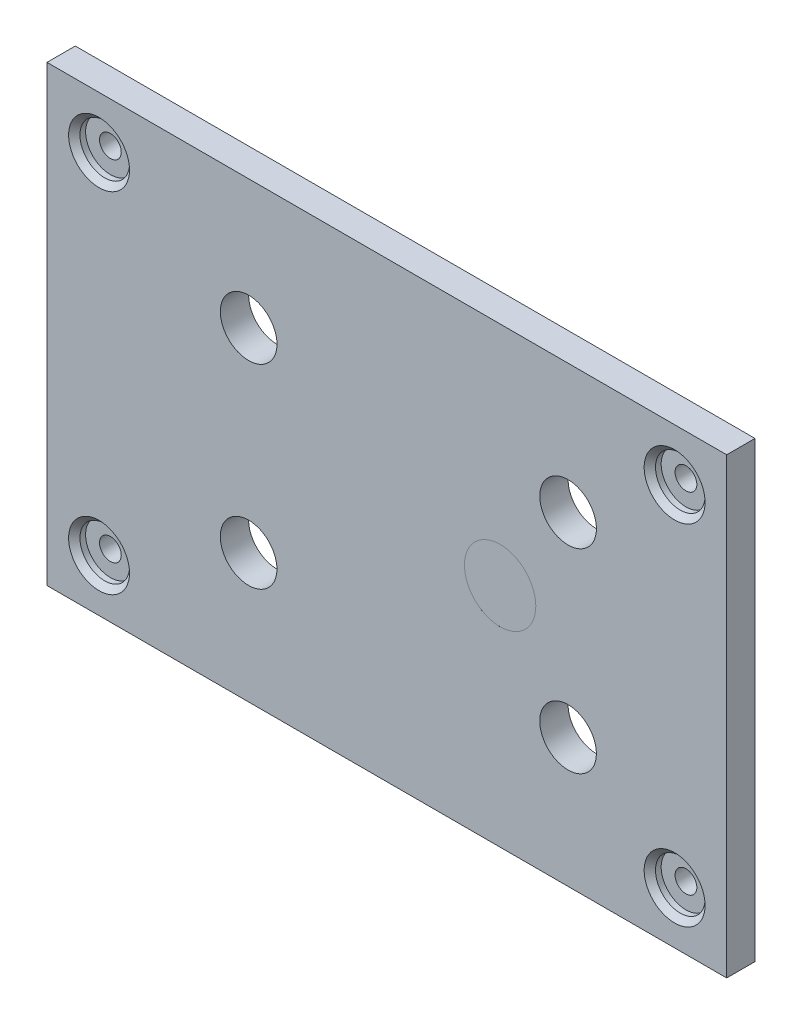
ISO-10303-21;
HEADER;
FILE_DESCRIPTION(('STEP AP214'),'2;1');
FILE_NAME('part.step','',(''),(''),'','','');
FILE_SCHEMA(('AUTOMOTIVE_DESIGN { 1 0 10303 214 1 1 1 1 }'));
ENDSEC;
DATA;
#1=APPLICATION_CONTEXT('core data for automotive mechanical design processes');
#2=APPLICATION_PROTOCOL_DEFINITION('international standard','automotive_design',2000,#1);
#3=PRODUCT_CONTEXT('',#1,'mechanical');
#4=PRODUCT('Part','Part','',(#3));
#5=PRODUCT_RELATED_PRODUCT_CATEGORY('part','',(#4));
#6=PRODUCT_DEFINITION_FORMATION('','',#4);
#7=PRODUCT_DEFINITION_CONTEXT('part definition',#1,'design');
#8=PRODUCT_DEFINITION('design','',#6,#7);
#9=PRODUCT_DEFINITION_SHAPE('','',#8);
#10=(LENGTH_UNIT() NAMED_UNIT(*) SI_UNIT(.MILLI.,.METRE.));
#11=(NAMED_UNIT(*) PLANE_ANGLE_UNIT() SI_UNIT($,.RADIAN.));
#12=(NAMED_UNIT(*) SI_UNIT($,.STERADIAN.) SOLID_ANGLE_UNIT());
#13=UNCERTAINTY_MEASURE_WITH_UNIT(LENGTH_MEASURE(1.E-05),#10,'distance_accuracy_value','');
#14=(GEOMETRIC_REPRESENTATION_CONTEXT(3) GLOBAL_UNCERTAINTY_ASSIGNED_CONTEXT((#13)) GLOBAL_UNIT_ASSIGNED_CONTEXT((#10,
#11,#12)) REPRESENTATION_CONTEXT('',''));
#15=CARTESIAN_POINT('',(0.,0.,0.));
#16=DIRECTION('',(0.,0.,1.));
#17=DIRECTION('',(1.,0.,0.));
#18=AXIS2_PLACEMENT_3D('',#15,#16,#17);
#19=CARTESIAN_POINT('',(0.,0.,3.175));
#20=DIRECTION('',(1.,0.,0.));
#21=DIRECTION('',(0.,0.,-1.));
#22=AXIS2_PLACEMENT_3D('',#19,#20,#21);
#23=PLANE('',#22);
#24=DIRECTION('',(0.,-1.,0.));
#25=VECTOR('',#24,1.);
#26=CARTESIAN_POINT('',(0.,0.,0.));
#27=LINE('',#26,#25);
#28=CARTESIAN_POINT('',(0.,50.8,0.));
#29=VERTEX_POINT('',#28);
#30=CARTESIAN_POINT('',(0.,0.,0.));
#31=VERTEX_POINT('',#30);
#32=EDGE_CURVE('E116',#29,#31,#27,.T.);
#33=ORIENTED_EDGE('',*,*,#32,.T.);
#34=DIRECTION('',(0.,0.,-1.));
#35=VECTOR('',#34,1.);
#36=CARTESIAN_POINT('',(0.,0.,3.175));
#37=LINE('',#36,#35);
#38=CARTESIAN_POINT('',(0.,0.,3.175));
#39=VERTEX_POINT('',#38);
#40=EDGE_CURVE('E11',#39,#31,#37,.T.);
#41=ORIENTED_EDGE('',*,*,#40,.F.);
#42=DIRECTION('',(0.,-1.,0.));
#43=VECTOR('',#42,1.);
#44=CARTESIAN_POINT('',(0.,0.,3.175));
#45=LINE('',#44,#43);
#46=CARTESIAN_POINT('',(0.,50.8,3.175));
#47=VERTEX_POINT('',#46);
#48=EDGE_CURVE('E99',#47,#39,#45,.T.);
#49=ORIENTED_EDGE('',*,*,#48,.F.);
#50=DIRECTION('',(0.,0.,-1.));
#51=VECTOR('',#50,1.);
#52=CARTESIAN_POINT('',(0.,50.8,3.175));
#53=LINE('',#52,#51);
#54=EDGE_CURVE('E112',#47,#29,#53,.T.);
#55=ORIENTED_EDGE('',*,*,#54,.T.);
#56=EDGE_LOOP('',(#33,#41,#49,#55));
#57=FACE_BOUND('',#56,.T.);
#58=ADVANCED_FACE('F45',(#57),#23,.F.);
#59=CARTESIAN_POINT('',(0.,0.,3.175));
#60=DIRECTION('',(0.,1.,0.));
#61=DIRECTION('',(0.,0.,1.));
#62=AXIS2_PLACEMENT_3D('',#59,#60,#61);
#63=PLANE('',#62);
#64=DIRECTION('',(1.,0.,0.));
#65=VECTOR('',#64,1.);
#66=CARTESIAN_POINT('',(0.,0.,0.));
#67=LINE('',#66,#65);
#68=CARTESIAN_POINT('',(76.2,0.,0.));
#69=VERTEX_POINT('',#68);
#70=EDGE_CURVE('E104',#31,#69,#67,.T.);
#71=ORIENTED_EDGE('',*,*,#70,.T.);
#72=DIRECTION('',(0.,0.,-1.));
#73=VECTOR('',#72,1.);
#74=CARTESIAN_POINT('',(76.2,0.,3.175));
#75=LINE('',#74,#73);
#76=CARTESIAN_POINT('',(76.2,0.,3.175));
#77=VERTEX_POINT('',#76);
#78=EDGE_CURVE('E55',#77,#69,#75,.T.);
#79=ORIENTED_EDGE('',*,*,#78,.F.);
#80=DIRECTION('',(1.,0.,0.));
#81=VECTOR('',#80,1.);
#82=CARTESIAN_POINT('',(0.,0.,3.175));
#83=LINE('',#82,#81);
#84=EDGE_CURVE('E94',#39,#77,#83,.T.);
#85=ORIENTED_EDGE('',*,*,#84,.F.);
#86=ORIENTED_EDGE('',*,*,#40,.T.);
#87=EDGE_LOOP('',(#71,#79,#85,#86));
#88=FACE_BOUND('',#87,.T.);
#89=ADVANCED_FACE('F103',(#88),#63,.F.);
#90=CARTESIAN_POINT('',(76.2,0.,3.175));
#91=DIRECTION('',(-1.,0.,0.));
#92=DIRECTION('',(0.,0.,1.));
#93=AXIS2_PLACEMENT_3D('',#90,#91,#92);
#94=PLANE('',#93);
#95=DIRECTION('',(0.,1.,0.));
#96=VECTOR('',#95,1.);
#97=CARTESIAN_POINT('',(76.2,0.,0.));
#98=LINE('',#97,#96);
#99=CARTESIAN_POINT('',(76.2,50.8,0.));
#100=VERTEX_POINT('',#99);
#101=EDGE_CURVE('E81',#69,#100,#98,.T.);
#102=ORIENTED_EDGE('',*,*,#101,.T.);
#103=DIRECTION('',(0.,0.,-1.));
#104=VECTOR('',#103,1.);
#105=CARTESIAN_POINT('',(76.2,50.8,3.175));
#106=LINE('',#105,#104);
#107=CARTESIAN_POINT('',(76.2,50.8,3.175));
#108=VERTEX_POINT('',#107);
#109=EDGE_CURVE('E106',#108,#100,#106,.T.);
#110=ORIENTED_EDGE('',*,*,#109,.F.);
#111=DIRECTION('',(0.,1.,0.));
#112=VECTOR('',#111,1.);
#113=CARTESIAN_POINT('',(76.2,0.,3.175));
#114=LINE('',#113,#112);
#115=EDGE_CURVE('E97',#77,#108,#114,.T.);
#116=ORIENTED_EDGE('',*,*,#115,.F.);
#117=ORIENTED_EDGE('',*,*,#78,.T.);
#118=EDGE_LOOP('',(#102,#110,#116,#117));
#119=FACE_BOUND('',#118,.T.);
#120=ADVANCED_FACE('F108',(#119),#94,.F.);
#121=CARTESIAN_POINT('',(0.,50.8,3.175));
#122=DIRECTION('',(0.,-1.,0.));
#123=DIRECTION('',(0.,0.,-1.));
#124=AXIS2_PLACEMENT_3D('',#121,#122,#123);
#125=PLANE('',#124);
#126=DIRECTION('',(-1.,0.,0.));
#127=VECTOR('',#126,1.);
#128=CARTESIAN_POINT('',(0.,50.8,0.));
#129=LINE('',#128,#127);
#130=EDGE_CURVE('E87',#100,#29,#129,.T.);
#131=ORIENTED_EDGE('',*,*,#130,.T.);
#132=ORIENTED_EDGE('',*,*,#54,.F.);
#133=DIRECTION('',(-1.,0.,0.));
#134=VECTOR('',#133,1.);
#135=CARTESIAN_POINT('',(0.,50.8,3.175));
#136=LINE('',#135,#134);
#137=EDGE_CURVE('E64',#108,#47,#136,.T.);
#138=ORIENTED_EDGE('',*,*,#137,.F.);
#139=ORIENTED_EDGE('',*,*,#109,.T.);
#140=EDGE_LOOP('',(#131,#132,#138,#139));
#141=FACE_BOUND('',#140,.T.);
#142=ADVANCED_FACE('F212',(#141),#125,.F.);
#143=CARTESIAN_POINT('',(0.,0.,3.175));
#144=DIRECTION('',(0.,0.,-1.));
#145=DIRECTION('',(-1.,0.,0.));
#146=AXIS2_PLACEMENT_3D('',#143,#144,#145);
#147=PLANE('',#146);
#148=CARTESIAN_POINT('',(58.4214304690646,36.3210018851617,3.175));
#149=DIRECTION('',(0.,0.,1.));
#150=DIRECTION('',(1.,0.,0.));
#151=AXIS2_PLACEMENT_3D('',#148,#149,#150);
#152=CIRCLE('',#151,3.175);
#153=CARTESIAN_POINT('',(61.5964304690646,36.3210018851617,3.175));
#154=VERTEX_POINT('',#153);
#155=EDGE_CURVE('E439',#154,#154,#152,.T.);
#156=ORIENTED_EDGE('',*,*,#155,.F.);
#157=EDGE_LOOP('',(#156));
#158=FACE_BOUND('',#157,.T.);
#159=CARTESIAN_POINT('',(22.6030007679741,14.4857454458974,3.175));
#160=DIRECTION('',(0.,0.,1.));
#161=DIRECTION('',(1.,0.,0.));
#162=AXIS2_PLACEMENT_3D('',#159,#160,#161);
#163=CIRCLE('',#162,3.175);
#164=CARTESIAN_POINT('',(25.7780007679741,14.4857454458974,3.175));
#165=VERTEX_POINT('',#164);
#166=EDGE_CURVE('E448',#165,#165,#163,.T.);
#167=ORIENTED_EDGE('',*,*,#166,.F.);
#168=EDGE_LOOP('',(#167));
#169=FACE_BOUND('',#168,.T.);
#170=CARTESIAN_POINT('',(58.4176178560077,14.4763383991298,3.175));
#171=DIRECTION('',(0.,0.,1.));
#172=DIRECTION('',(1.,0.,0.));
#173=AXIS2_PLACEMENT_3D('',#170,#171,#172);
#174=CIRCLE('',#173,3.175);
#175=CARTESIAN_POINT('',(61.5926178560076,14.4763383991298,3.175));
#176=VERTEX_POINT('',#175);
#177=EDGE_CURVE('E461',#176,#176,#174,.T.);
#178=ORIENTED_EDGE('',*,*,#177,.F.);
#179=EDGE_LOOP('',(#178));
#180=FACE_BOUND('',#179,.T.);
#181=CARTESIAN_POINT('',(22.6068122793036,36.3240964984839,3.175));
#182=DIRECTION('',(0.,0.,1.));
#183=DIRECTION('',(1.,0.,0.));
#184=AXIS2_PLACEMENT_3D('',#181,#182,#183);
#185=CIRCLE('',#184,3.175);
#186=CARTESIAN_POINT('',(25.7818122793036,36.3240964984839,3.175));
#187=VERTEX_POINT('',#186);
#188=EDGE_CURVE('E441',#187,#187,#185,.T.);
#189=ORIENTED_EDGE('',*,*,#188,.F.);
#190=EDGE_LOOP('',(#189));
#191=FACE_BOUND('',#190,.T.);
#192=CARTESIAN_POINT('',(50.8,25.4,3.175));
#193=DIRECTION('',(0.,0.,1.));
#194=DIRECTION('',(1.,0.,0.));
#195=AXIS2_PLACEMENT_3D('',#192,#193,#194);
#196=CIRCLE('',#195,4.0005);
#197=CARTESIAN_POINT('',(54.8005,25.4,3.175));
#198=VERTEX_POINT('',#197);
#199=EDGE_CURVE('E464',#198,#198,#196,.T.);
#200=ORIENTED_EDGE('',*,*,#199,.F.);
#201=EDGE_LOOP('',(#200));
#202=FACE_BOUND('',#201,.T.);
#203=CARTESIAN_POINT('',(5.83716647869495,44.9628335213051,3.175));
#204=DIRECTION('',(0.,0.,1.));
#205=DIRECTION('',(1.,0.,0.));
#206=AXIS2_PLACEMENT_3D('',#203,#204,#205);
#207=CIRCLE('',#206,3.41376);
#208=CARTESIAN_POINT('',(9.25092647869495,44.9628335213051,3.175));
#209=VERTEX_POINT('',#208);
#210=EDGE_CURVE('E470',#209,#209,#207,.T.);
#211=ORIENTED_EDGE('',*,*,#210,.F.);
#212=EDGE_LOOP('',(#211));
#213=FACE_BOUND('',#212,.T.);
#214=CARTESIAN_POINT('',(70.362833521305,44.9628335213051,3.175));
#215=DIRECTION('',(0.,0.,1.));
#216=DIRECTION('',(1.,0.,0.));
#217=AXIS2_PLACEMENT_3D('',#214,#215,#216);
#218=CIRCLE('',#217,3.41376);
#219=CARTESIAN_POINT('',(73.776593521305,44.9628335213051,3.175));
#220=VERTEX_POINT('',#219);
#221=EDGE_CURVE('E489',#220,#220,#218,.T.);
#222=ORIENTED_EDGE('',*,*,#221,.F.);
#223=EDGE_LOOP('',(#222));
#224=FACE_BOUND('',#223,.T.);
#225=CARTESIAN_POINT('',(5.83716647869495,5.83716647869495,3.175));
#226=DIRECTION('',(0.,0.,1.));
#227=DIRECTION('',(1.,0.,0.));
#228=AXIS2_PLACEMENT_3D('',#225,#226,#227);
#229=CIRCLE('',#228,3.41376);
#230=CARTESIAN_POINT('',(9.25092647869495,5.83716647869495,3.175));
#231=VERTEX_POINT('',#230);
#232=EDGE_CURVE('E143',#231,#231,#229,.T.);
#233=ORIENTED_EDGE('',*,*,#232,.F.);
#234=EDGE_LOOP('',(#233));
#235=FACE_BOUND('',#234,.T.);
#236=CARTESIAN_POINT('',(70.362833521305,5.83716647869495,3.175));
#237=DIRECTION('',(0.,0.,1.));
#238=DIRECTION('',(1.,0.,0.));
#239=AXIS2_PLACEMENT_3D('',#236,#237,#238);
#240=CIRCLE('',#239,3.41376);
#241=CARTESIAN_POINT('',(73.776593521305,5.83716647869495,3.175));
#242=VERTEX_POINT('',#241);
#243=EDGE_CURVE('E138',#242,#242,#240,.T.);
#244=ORIENTED_EDGE('',*,*,#243,.F.);
#245=EDGE_LOOP('',(#244));
#246=FACE_BOUND('',#245,.T.);
#247=ORIENTED_EDGE('',*,*,#48,.T.);
#248=ORIENTED_EDGE('',*,*,#84,.T.);
#249=ORIENTED_EDGE('',*,*,#115,.T.);
#250=ORIENTED_EDGE('',*,*,#137,.T.);
#251=EDGE_LOOP('',(#247,#248,#249,#250));
#252=FACE_BOUND('',#251,.T.);
#253=ADVANCED_FACE('F95',(#158,#169,#180,#191,#202,#213,#224,#235,#246,#252),#147,.F.);
#254=CARTESIAN_POINT('',(0.,0.,0.));
#255=DIRECTION('',(0.,0.,-1.));
#256=DIRECTION('',(-1.,0.,0.));
#257=AXIS2_PLACEMENT_3D('',#254,#255,#256);
#258=PLANE('',#257);
#259=CARTESIAN_POINT('',(58.4214304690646,36.3210018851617,0.));
#260=DIRECTION('',(0.,0.,1.));
#261=DIRECTION('',(1.,0.,0.));
#262=AXIS2_PLACEMENT_3D('',#259,#260,#261);
#263=CIRCLE('',#262,3.175);
#264=CARTESIAN_POINT('',(61.5964304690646,36.3210018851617,0.));
#265=VERTEX_POINT('',#264);
#266=EDGE_CURVE('E437',#265,#265,#263,.T.);
#267=ORIENTED_EDGE('',*,*,#266,.T.);
#268=EDGE_LOOP('',(#267));
#269=FACE_BOUND('',#268,.T.);
#270=CARTESIAN_POINT('',(22.6030007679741,14.4857454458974,0.));
#271=DIRECTION('',(0.,0.,1.));
#272=DIRECTION('',(1.,0.,0.));
#273=AXIS2_PLACEMENT_3D('',#270,#271,#272);
#274=CIRCLE('',#273,3.175);
#275=CARTESIAN_POINT('',(25.7780007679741,14.4857454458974,0.));
#276=VERTEX_POINT('',#275);
#277=EDGE_CURVE('E457',#276,#276,#274,.T.);
#278=ORIENTED_EDGE('',*,*,#277,.T.);
#279=EDGE_LOOP('',(#278));
#280=FACE_BOUND('',#279,.T.);
#281=CARTESIAN_POINT('',(58.4176178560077,14.4763383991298,0.));
#282=DIRECTION('',(0.,0.,1.));
#283=DIRECTION('',(1.,0.,0.));
#284=AXIS2_PLACEMENT_3D('',#281,#282,#283);
#285=CIRCLE('',#284,3.175);
#286=CARTESIAN_POINT('',(61.5926178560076,14.4763383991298,0.));
#287=VERTEX_POINT('',#286);
#288=EDGE_CURVE('E451',#287,#287,#285,.T.);
#289=ORIENTED_EDGE('',*,*,#288,.T.);
#290=EDGE_LOOP('',(#289));
#291=FACE_BOUND('',#290,.T.);
#292=CARTESIAN_POINT('',(22.6068122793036,36.3240964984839,0.));
#293=DIRECTION('',(0.,0.,1.));
#294=DIRECTION('',(1.,0.,0.));
#295=AXIS2_PLACEMENT_3D('',#292,#293,#294);
#296=CIRCLE('',#295,3.175);
#297=CARTESIAN_POINT('',(25.7818122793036,36.3240964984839,0.));
#298=VERTEX_POINT('',#297);
#299=EDGE_CURVE('E446',#298,#298,#296,.T.);
#300=ORIENTED_EDGE('',*,*,#299,.T.);
#301=EDGE_LOOP('',(#300));
#302=FACE_BOUND('',#301,.T.);
#303=CARTESIAN_POINT('',(5.83716647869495,44.9628335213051,0.));
#304=DIRECTION('',(0.,0.,-1.));
#305=DIRECTION('',(-1.,0.,0.));
#306=AXIS2_PLACEMENT_3D('',#303,#304,#305);
#307=CIRCLE('',#306,1.2192);
#308=CARTESIAN_POINT('',(4.61796647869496,44.9628335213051,0.));
#309=VERTEX_POINT('',#308);
#310=EDGE_CURVE('E48',#309,#309,#307,.T.);
#311=ORIENTED_EDGE('',*,*,#310,.F.);
#312=EDGE_LOOP('',(#311));
#313=FACE_BOUND('',#312,.T.);
#314=CARTESIAN_POINT('',(70.362833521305,44.9628335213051,0.));
#315=DIRECTION('',(0.,0.,-1.));
#316=DIRECTION('',(-1.,0.,0.));
#317=AXIS2_PLACEMENT_3D('',#314,#315,#316);
#318=CIRCLE('',#317,1.2192);
#319=CARTESIAN_POINT('',(69.143633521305,44.9628335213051,0.));
#320=VERTEX_POINT('',#319);
#321=EDGE_CURVE('E140',#320,#320,#318,.T.);
#322=ORIENTED_EDGE('',*,*,#321,.F.);
#323=EDGE_LOOP('',(#322));
#324=FACE_BOUND('',#323,.T.);
#325=CARTESIAN_POINT('',(5.83716647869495,5.83716647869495,0.));
#326=DIRECTION('',(0.,0.,-1.));
#327=DIRECTION('',(-1.,0.,0.));
#328=AXIS2_PLACEMENT_3D('',#325,#326,#327);
#329=CIRCLE('',#328,1.2192);
#330=CARTESIAN_POINT('',(4.61796647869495,5.83716647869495,0.));
#331=VERTEX_POINT('',#330);
#332=EDGE_CURVE('E135',#331,#331,#329,.T.);
#333=ORIENTED_EDGE('',*,*,#332,.F.);
#334=EDGE_LOOP('',(#333));
#335=FACE_BOUND('',#334,.T.);
#336=CARTESIAN_POINT('',(70.362833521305,5.83716647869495,0.));
#337=DIRECTION('',(0.,0.,-1.));
#338=DIRECTION('',(-1.,0.,0.));
#339=AXIS2_PLACEMENT_3D('',#336,#337,#338);
#340=CIRCLE('',#339,1.2192);
#341=CARTESIAN_POINT('',(69.143633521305,5.83716647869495,0.));
#342=VERTEX_POINT('',#341);
#343=EDGE_CURVE('E120',#342,#342,#340,.T.);
#344=ORIENTED_EDGE('',*,*,#343,.F.);
#345=EDGE_LOOP('',(#344));
#346=FACE_BOUND('',#345,.T.);
#347=ORIENTED_EDGE('',*,*,#32,.F.);
#348=ORIENTED_EDGE('',*,*,#130,.F.);
#349=ORIENTED_EDGE('',*,*,#101,.F.);
#350=ORIENTED_EDGE('',*,*,#70,.F.);
#351=EDGE_LOOP('',(#347,#348,#349,#350));
#352=FACE_BOUND('',#351,.T.);
#353=ADVANCED_FACE('F211',(#269,#280,#291,#302,#313,#324,#335,#346,#352),#258,.T.);
#354=CARTESIAN_POINT('',(70.362833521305,5.83716647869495,3.175));
#355=DIRECTION('',(0.,0.,1.));
#356=DIRECTION('',(1.,0.,0.));
#357=AXIS2_PLACEMENT_3D('',#354,#355,#356);
#358=CYLINDRICAL_SURFACE('',#357,1.2192);
#359=ORIENTED_EDGE('',*,*,#343,.T.);
#360=EDGE_LOOP('',(#359));
#361=FACE_BOUND('',#360,.T.);
#362=CARTESIAN_POINT('',(70.362833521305,5.83716647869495,1.905));
#363=DIRECTION('',(0.,0.,1.));
#364=DIRECTION('',(1.,0.,0.));
#365=AXIS2_PLACEMENT_3D('',#362,#363,#364);
#366=CIRCLE('',#365,1.2192);
#367=CARTESIAN_POINT('',(71.582033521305,5.83716647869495,1.905));
#368=VERTEX_POINT('',#367);
#369=EDGE_CURVE('E134',#368,#368,#366,.T.);
#370=ORIENTED_EDGE('',*,*,#369,.T.);
#371=EDGE_LOOP('',(#370));
#372=FACE_BOUND('',#371,.T.);
#373=ADVANCED_FACE('F189',(#361,#372),#358,.F.);
#374=CARTESIAN_POINT('',(71.582033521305,5.83716647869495,1.905));
#375=DIRECTION('',(0.,0.,-1.));
#376=DIRECTION('',(-1.,0.,0.));
#377=AXIS2_PLACEMENT_3D('',#374,#375,#376);
#378=PLANE('',#377);
#379=ORIENTED_EDGE('',*,*,#369,.F.);
#380=EDGE_LOOP('',(#379));
#381=FACE_BOUND('',#380,.T.);
#382=CARTESIAN_POINT('',(70.362833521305,5.83716647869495,1.905));
#383=DIRECTION('',(0.,0.,1.));
#384=DIRECTION('',(1.,0.,0.));
#385=AXIS2_PLACEMENT_3D('',#382,#383,#384);
#386=CIRCLE('',#385,2.77876000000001);
#387=CARTESIAN_POINT('',(73.141593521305,5.83716647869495,1.905));
#388=VERTEX_POINT('',#387);
#389=EDGE_CURVE('E180',#388,#388,#386,.T.);
#390=ORIENTED_EDGE('',*,*,#389,.T.);
#391=EDGE_LOOP('',(#390));
#392=FACE_BOUND('',#391,.T.);
#393=ADVANCED_FACE('F191',(#381,#392),#378,.F.);
#394=CARTESIAN_POINT('',(70.362833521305,5.83716647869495,3.175));
#395=DIRECTION('',(0.,0.,1.));
#396=DIRECTION('',(1.,0.,0.));
#397=AXIS2_PLACEMENT_3D('',#394,#395,#396);
#398=CYLINDRICAL_SURFACE('',#397,2.77876000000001);
#399=ORIENTED_EDGE('',*,*,#389,.F.);
#400=EDGE_LOOP('',(#399));
#401=FACE_BOUND('',#400,.T.);
#402=CARTESIAN_POINT('',(70.362833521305,5.83716647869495,2.54));
#403=DIRECTION('',(0.,0.,1.));
#404=DIRECTION('',(1.,0.,0.));
#405=AXIS2_PLACEMENT_3D('',#402,#403,#404);
#406=CIRCLE('',#405,2.77876000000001);
#407=CARTESIAN_POINT('',(73.141593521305,5.83716647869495,2.54));
#408=VERTEX_POINT('',#407);
#409=EDGE_CURVE('E176',#408,#408,#406,.T.);
#410=ORIENTED_EDGE('',*,*,#409,.T.);
#411=EDGE_LOOP('',(#410));
#412=FACE_BOUND('',#411,.T.);
#413=ADVANCED_FACE('F194',(#401,#412),#398,.F.);
#414=CARTESIAN_POINT('',(70.362833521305,5.83716647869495,3.175));
#415=DIRECTION('',(0.,0.,1.));
#416=DIRECTION('',(1.,0.,0.));
#417=AXIS2_PLACEMENT_3D('',#414,#415,#416);
#418=CONICAL_SURFACE('',#417,3.41376,0.785398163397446);
#419=ORIENTED_EDGE('',*,*,#409,.F.);
#420=EDGE_LOOP('',(#419));
#421=FACE_BOUND('',#420,.T.);
#422=ORIENTED_EDGE('',*,*,#243,.T.);
#423=EDGE_LOOP('',(#422));
#424=FACE_BOUND('',#423,.T.);
#425=ADVANCED_FACE('F200',(#421,#424),#418,.F.);
#426=CARTESIAN_POINT('',(5.83716647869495,5.83716647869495,3.175));
#427=DIRECTION('',(0.,0.,1.));
#428=DIRECTION('',(1.,0.,0.));
#429=AXIS2_PLACEMENT_3D('',#426,#427,#428);
#430=CYLINDRICAL_SURFACE('',#429,1.2192);
#431=ORIENTED_EDGE('',*,*,#332,.T.);
#432=EDGE_LOOP('',(#431));
#433=FACE_BOUND('',#432,.T.);
#434=CARTESIAN_POINT('',(5.83716647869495,5.83716647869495,1.905));
#435=DIRECTION('',(0.,0.,1.));
#436=DIRECTION('',(1.,0.,0.));
#437=AXIS2_PLACEMENT_3D('',#434,#435,#436);
#438=CIRCLE('',#437,1.2192);
#439=CARTESIAN_POINT('',(7.05636647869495,5.83716647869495,1.905));
#440=VERTEX_POINT('',#439);
#441=EDGE_CURVE('E139',#440,#440,#438,.T.);
#442=ORIENTED_EDGE('',*,*,#441,.T.);
#443=EDGE_LOOP('',(#442));
#444=FACE_BOUND('',#443,.T.);
#445=ADVANCED_FACE('F206',(#433,#444),#430,.F.);
#446=CARTESIAN_POINT('',(7.05636647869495,5.83716647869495,1.905));
#447=DIRECTION('',(0.,0.,-1.));
#448=DIRECTION('',(-1.,0.,0.));
#449=AXIS2_PLACEMENT_3D('',#446,#447,#448);
#450=PLANE('',#449);
#451=ORIENTED_EDGE('',*,*,#441,.F.);
#452=EDGE_LOOP('',(#451));
#453=FACE_BOUND('',#452,.T.);
#454=CARTESIAN_POINT('',(5.83716647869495,5.83716647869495,1.905));
#455=DIRECTION('',(0.,0.,1.));
#456=DIRECTION('',(1.,0.,0.));
#457=AXIS2_PLACEMENT_3D('',#454,#455,#456);
#458=CIRCLE('',#457,2.77876);
#459=CARTESIAN_POINT('',(8.61592647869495,5.83716647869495,1.905));
#460=VERTEX_POINT('',#459);
#461=EDGE_CURVE('E166',#460,#460,#458,.T.);
#462=ORIENTED_EDGE('',*,*,#461,.T.);
#463=EDGE_LOOP('',(#462));
#464=FACE_BOUND('',#463,.T.);
#465=ADVANCED_FACE('F274',(#453,#464),#450,.F.);
#466=CARTESIAN_POINT('',(5.83716647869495,5.83716647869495,3.175));
#467=DIRECTION('',(0.,0.,1.));
#468=DIRECTION('',(1.,0.,0.));
#469=AXIS2_PLACEMENT_3D('',#466,#467,#468);
#470=CYLINDRICAL_SURFACE('',#469,2.77876);
#471=ORIENTED_EDGE('',*,*,#461,.F.);
#472=EDGE_LOOP('',(#471));
#473=FACE_BOUND('',#472,.T.);
#474=CARTESIAN_POINT('',(5.83716647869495,5.83716647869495,2.54));
#475=DIRECTION('',(0.,0.,1.));
#476=DIRECTION('',(1.,0.,0.));
#477=AXIS2_PLACEMENT_3D('',#474,#475,#476);
#478=CIRCLE('',#477,2.77876);
#479=CARTESIAN_POINT('',(8.61592647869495,5.83716647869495,2.54));
#480=VERTEX_POINT('',#479);
#481=EDGE_CURVE('E150',#480,#480,#478,.T.);
#482=ORIENTED_EDGE('',*,*,#481,.T.);
#483=EDGE_LOOP('',(#482));
#484=FACE_BOUND('',#483,.T.);
#485=ADVANCED_FACE('F283',(#473,#484),#470,.F.);
#486=CARTESIAN_POINT('',(5.83716647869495,5.83716647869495,3.175));
#487=DIRECTION('',(0.,0.,1.));
#488=DIRECTION('',(1.,0.,0.));
#489=AXIS2_PLACEMENT_3D('',#486,#487,#488);
#490=CONICAL_SURFACE('',#489,3.41376,0.785398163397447);
#491=ORIENTED_EDGE('',*,*,#481,.F.);
#492=EDGE_LOOP('',(#491));
#493=FACE_BOUND('',#492,.T.);
#494=ORIENTED_EDGE('',*,*,#232,.T.);
#495=EDGE_LOOP('',(#494));
#496=FACE_BOUND('',#495,.T.);
#497=ADVANCED_FACE('F292',(#493,#496),#490,.F.);
#498=CARTESIAN_POINT('',(70.362833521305,44.9628335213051,3.175));
#499=DIRECTION('',(0.,0.,1.));
#500=DIRECTION('',(1.,0.,0.));
#501=AXIS2_PLACEMENT_3D('',#498,#499,#500);
#502=CYLINDRICAL_SURFACE('',#501,1.2192);
#503=ORIENTED_EDGE('',*,*,#321,.T.);
#504=EDGE_LOOP('',(#503));
#505=FACE_BOUND('',#504,.T.);
#506=CARTESIAN_POINT('',(70.362833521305,44.9628335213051,1.905));
#507=DIRECTION('',(0.,0.,1.));
#508=DIRECTION('',(1.,0.,0.));
#509=AXIS2_PLACEMENT_3D('',#506,#507,#508);
#510=CIRCLE('',#509,1.2192);
#511=CARTESIAN_POINT('',(71.582033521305,44.9628335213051,1.905));
#512=VERTEX_POINT('',#511);
#513=EDGE_CURVE('E144',#512,#512,#510,.T.);
#514=ORIENTED_EDGE('',*,*,#513,.T.);
#515=EDGE_LOOP('',(#514));
#516=FACE_BOUND('',#515,.T.);
#517=ADVANCED_FACE('F301',(#505,#516),#502,.F.);
#518=CARTESIAN_POINT('',(71.582033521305,44.9628335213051,1.905));
#519=DIRECTION('',(0.,0.,-1.));
#520=DIRECTION('',(-1.,0.,0.));
#521=AXIS2_PLACEMENT_3D('',#518,#519,#520);
#522=PLANE('',#521);
#523=ORIENTED_EDGE('',*,*,#513,.F.);
#524=EDGE_LOOP('',(#523));
#525=FACE_BOUND('',#524,.T.);
#526=CARTESIAN_POINT('',(70.362833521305,44.9628335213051,1.905));
#527=DIRECTION('',(0.,0.,1.));
#528=DIRECTION('',(1.,0.,0.));
#529=AXIS2_PLACEMENT_3D('',#526,#527,#528);
#530=CIRCLE('',#529,2.77876000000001);
#531=CARTESIAN_POINT('',(73.141593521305,44.9628335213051,1.905));
#532=VERTEX_POINT('',#531);
#533=EDGE_CURVE('E153',#532,#532,#530,.T.);
#534=ORIENTED_EDGE('',*,*,#533,.T.);
#535=EDGE_LOOP('',(#534));
#536=FACE_BOUND('',#535,.T.);
#537=ADVANCED_FACE('F310',(#525,#536),#522,.F.);
#538=CARTESIAN_POINT('',(70.362833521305,44.9628335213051,3.175));
#539=DIRECTION('',(0.,0.,1.));
#540=DIRECTION('',(1.,0.,0.));
#541=AXIS2_PLACEMENT_3D('',#538,#539,#540);
#542=CYLINDRICAL_SURFACE('',#541,2.77876000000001);
#543=ORIENTED_EDGE('',*,*,#533,.F.);
#544=EDGE_LOOP('',(#543));
#545=FACE_BOUND('',#544,.T.);
#546=CARTESIAN_POINT('',(70.362833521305,44.9628335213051,2.54));
#547=DIRECTION('',(0.,0.,1.));
#548=DIRECTION('',(1.,0.,0.));
#549=AXIS2_PLACEMENT_3D('',#546,#547,#548);
#550=CIRCLE('',#549,2.77876000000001);
#551=CARTESIAN_POINT('',(73.141593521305,44.9628335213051,2.54));
#552=VERTEX_POINT('',#551);
#553=EDGE_CURVE('E159',#552,#552,#550,.T.);
#554=ORIENTED_EDGE('',*,*,#553,.T.);
#555=EDGE_LOOP('',(#554));
#556=FACE_BOUND('',#555,.T.);
#557=ADVANCED_FACE('F318',(#545,#556),#542,.F.);
#558=CARTESIAN_POINT('',(70.362833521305,44.9628335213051,3.175));
#559=DIRECTION('',(0.,0.,1.));
#560=DIRECTION('',(1.,0.,0.));
#561=AXIS2_PLACEMENT_3D('',#558,#559,#560);
#562=CONICAL_SURFACE('',#561,3.41376,0.785398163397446);
#563=ORIENTED_EDGE('',*,*,#553,.F.);
#564=EDGE_LOOP('',(#563));
#565=FACE_BOUND('',#564,.T.);
#566=ORIENTED_EDGE('',*,*,#221,.T.);
#567=EDGE_LOOP('',(#566));
#568=FACE_BOUND('',#567,.T.);
#569=ADVANCED_FACE('F327',(#565,#568),#562,.F.);
#570=CARTESIAN_POINT('',(5.83716647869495,44.9628335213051,3.175));
#571=DIRECTION('',(0.,0.,1.));
#572=DIRECTION('',(1.,0.,0.));
#573=AXIS2_PLACEMENT_3D('',#570,#571,#572);
#574=CYLINDRICAL_SURFACE('',#573,1.2192);
#575=ORIENTED_EDGE('',*,*,#310,.T.);
#576=EDGE_LOOP('',(#575));
#577=FACE_BOUND('',#576,.T.);
#578=CARTESIAN_POINT('',(5.83716647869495,44.9628335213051,1.905));
#579=DIRECTION('',(0.,0.,1.));
#580=DIRECTION('',(1.,0.,0.));
#581=AXIS2_PLACEMENT_3D('',#578,#579,#580);
#582=CIRCLE('',#581,1.2192);
#583=CARTESIAN_POINT('',(7.05636647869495,44.9628335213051,1.905));
#584=VERTEX_POINT('',#583);
#585=EDGE_CURVE('E485',#584,#584,#582,.T.);
#586=ORIENTED_EDGE('',*,*,#585,.T.);
#587=EDGE_LOOP('',(#586));
#588=FACE_BOUND('',#587,.T.);
#589=ADVANCED_FACE('F336',(#577,#588),#574,.F.);
#590=CARTESIAN_POINT('',(7.05636647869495,44.9628335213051,1.905));
#591=DIRECTION('',(0.,0.,-1.));
#592=DIRECTION('',(-1.,0.,0.));
#593=AXIS2_PLACEMENT_3D('',#590,#591,#592);
#594=PLANE('',#593);
#595=ORIENTED_EDGE('',*,*,#585,.F.);
#596=EDGE_LOOP('',(#595));
#597=FACE_BOUND('',#596,.T.);
#598=CARTESIAN_POINT('',(5.83716647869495,44.9628335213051,1.905));
#599=DIRECTION('',(0.,0.,1.));
#600=DIRECTION('',(1.,0.,0.));
#601=AXIS2_PLACEMENT_3D('',#598,#599,#600);
#602=CIRCLE('',#601,2.77876);
#603=CARTESIAN_POINT('',(8.61592647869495,44.9628335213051,1.905));
#604=VERTEX_POINT('',#603);
#605=EDGE_CURVE('E481',#604,#604,#602,.T.);
#606=ORIENTED_EDGE('',*,*,#605,.T.);
#607=EDGE_LOOP('',(#606));
#608=FACE_BOUND('',#607,.T.);
#609=ADVANCED_FACE('F345',(#597,#608),#594,.F.);
#610=CARTESIAN_POINT('',(5.83716647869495,44.9628335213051,3.175));
#611=DIRECTION('',(0.,0.,1.));
#612=DIRECTION('',(1.,0.,0.));
#613=AXIS2_PLACEMENT_3D('',#610,#611,#612);
#614=CYLINDRICAL_SURFACE('',#613,2.77876);
#615=ORIENTED_EDGE('',*,*,#605,.F.);
#616=EDGE_LOOP('',(#615));
#617=FACE_BOUND('',#616,.T.);
#618=CARTESIAN_POINT('',(5.83716647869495,44.9628335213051,2.54));
#619=DIRECTION('',(0.,0.,1.));
#620=DIRECTION('',(1.,0.,0.));
#621=AXIS2_PLACEMENT_3D('',#618,#619,#620);
#622=CIRCLE('',#621,2.77876);
#623=CARTESIAN_POINT('',(8.61592647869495,44.9628335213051,2.54));
#624=VERTEX_POINT('',#623);
#625=EDGE_CURVE('E477',#624,#624,#622,.T.);
#626=ORIENTED_EDGE('',*,*,#625,.T.);
#627=EDGE_LOOP('',(#626));
#628=FACE_BOUND('',#627,.T.);
#629=ADVANCED_FACE('F354',(#617,#628),#614,.F.);
#630=CARTESIAN_POINT('',(5.83716647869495,44.9628335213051,3.175));
#631=DIRECTION('',(0.,0.,1.));
#632=DIRECTION('',(1.,0.,0.));
#633=AXIS2_PLACEMENT_3D('',#630,#631,#632);
#634=CONICAL_SURFACE('',#633,3.41376,0.785398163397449);
#635=ORIENTED_EDGE('',*,*,#625,.F.);
#636=EDGE_LOOP('',(#635));
#637=FACE_BOUND('',#636,.T.);
#638=ORIENTED_EDGE('',*,*,#210,.T.);
#639=EDGE_LOOP('',(#638));
#640=FACE_BOUND('',#639,.T.);
#641=ADVANCED_FACE('F363',(#637,#640),#634,.F.);
#642=CARTESIAN_POINT('',(50.8,25.4,3.174746));
#643=DIRECTION('',(0.,0.,1.));
#644=DIRECTION('',(1.,0.,0.));
#645=AXIS2_PLACEMENT_3D('',#642,#643,#644);
#646=CYLINDRICAL_SURFACE('',#645,4.0005);
#647=CARTESIAN_POINT('',(50.8,25.4,3.174746));
#648=DIRECTION('',(0.,0.,1.));
#649=DIRECTION('',(1.,0.,0.));
#650=AXIS2_PLACEMENT_3D('',#647,#648,#649);
#651=CIRCLE('',#650,4.0005);
#652=CARTESIAN_POINT('',(54.8005,25.4,3.174746));
#653=VERTEX_POINT('',#652);
#654=EDGE_CURVE('E466',#653,#653,#651,.T.);
#655=ORIENTED_EDGE('',*,*,#654,.F.);
#656=EDGE_LOOP('',(#655));
#657=FACE_BOUND('',#656,.T.);
#658=ORIENTED_EDGE('',*,*,#199,.T.);
#659=EDGE_LOOP('',(#658));
#660=FACE_BOUND('',#659,.T.);
#661=ADVANCED_FACE('F372',(#657,#660),#646,.F.);
#662=CARTESIAN_POINT('',(50.8,25.4,3.174746));
#663=DIRECTION('',(0.,0.,1.));
#664=DIRECTION('',(1.,0.,0.));
#665=AXIS2_PLACEMENT_3D('',#662,#663,#664);
#666=PLANE('',#665);
#667=ORIENTED_EDGE('',*,*,#654,.T.);
#668=EDGE_LOOP('',(#667));
#669=FACE_BOUND('',#668,.T.);
#670=ADVANCED_FACE('F380',(#669),#666,.T.);
#671=CARTESIAN_POINT('',(22.6068122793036,36.3240964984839,0.));
#672=DIRECTION('',(0.,0.,1.));
#673=DIRECTION('',(1.,0.,0.));
#674=AXIS2_PLACEMENT_3D('',#671,#672,#673);
#675=CYLINDRICAL_SURFACE('',#674,3.175);
#676=ORIENTED_EDGE('',*,*,#299,.F.);
#677=EDGE_LOOP('',(#676));
#678=FACE_BOUND('',#677,.T.);
#679=ORIENTED_EDGE('',*,*,#188,.T.);
#680=EDGE_LOOP('',(#679));
#681=FACE_BOUND('',#680,.T.);
#682=ADVANCED_FACE('F388',(#678,#681),#675,.F.);
#683=CARTESIAN_POINT('',(58.4176178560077,14.4763383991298,0.));
#684=DIRECTION('',(0.,0.,1.));
#685=DIRECTION('',(1.,0.,0.));
#686=AXIS2_PLACEMENT_3D('',#683,#684,#685);
#687=CYLINDRICAL_SURFACE('',#686,3.175);
#688=ORIENTED_EDGE('',*,*,#288,.F.);
#689=EDGE_LOOP('',(#688));
#690=FACE_BOUND('',#689,.T.);
#691=ORIENTED_EDGE('',*,*,#177,.T.);
#692=EDGE_LOOP('',(#691));
#693=FACE_BOUND('',#692,.T.);
#694=ADVANCED_FACE('F401',(#690,#693),#687,.F.);
#695=CARTESIAN_POINT('',(22.6030007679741,14.4857454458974,0.));
#696=DIRECTION('',(0.,0.,1.));
#697=DIRECTION('',(1.,0.,0.));
#698=AXIS2_PLACEMENT_3D('',#695,#696,#697);
#699=CYLINDRICAL_SURFACE('',#698,3.175);
#700=ORIENTED_EDGE('',*,*,#277,.F.);
#701=EDGE_LOOP('',(#700));
#702=FACE_BOUND('',#701,.T.);
#703=ORIENTED_EDGE('',*,*,#166,.T.);
#704=EDGE_LOOP('',(#703));
#705=FACE_BOUND('',#704,.T.);
#706=ADVANCED_FACE('F411',(#702,#705),#699,.F.);
#707=CARTESIAN_POINT('',(58.4214304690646,36.3210018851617,0.));
#708=DIRECTION('',(0.,0.,1.));
#709=DIRECTION('',(1.,0.,0.));
#710=AXIS2_PLACEMENT_3D('',#707,#708,#709);
#711=CYLINDRICAL_SURFACE('',#710,3.175);
#712=ORIENTED_EDGE('',*,*,#266,.F.);
#713=EDGE_LOOP('',(#712));
#714=FACE_BOUND('',#713,.T.);
#715=ORIENTED_EDGE('',*,*,#155,.T.);
#716=EDGE_LOOP('',(#715));
#717=FACE_BOUND('',#716,.T.);
#718=ADVANCED_FACE('F421',(#714,#717),#711,.F.);
#719=CLOSED_SHELL('',(#58,#89,#120,#142,#253,#353,#373,#393,#413,#425,#445,#465,#485,#497,#517,
#537,#557,#569,#589,#609,#629,#641,#661,#670,#682,#694,#706,#718));
#720=MANIFOLD_SOLID_BREP('B2',#719);
#721=ADVANCED_BREP_SHAPE_REPRESENTATION('',(#18,#720),#14);
#722=SHAPE_DEFINITION_REPRESENTATION(#9,#721);
ENDSEC;
END-ISO-10303-21;
